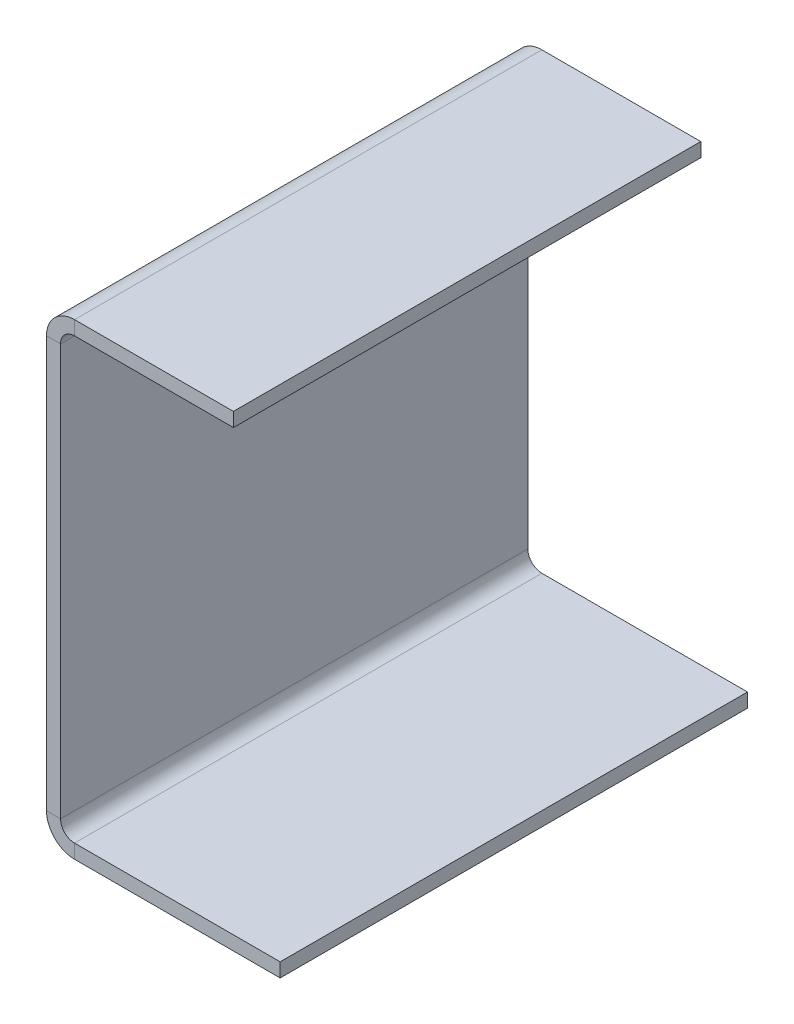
ISO-10303-21;
HEADER;
FILE_DESCRIPTION(('STEP AP214'),'2;1');
FILE_NAME('part.step','',(''),(''),'','','');
FILE_SCHEMA(('AUTOMOTIVE_DESIGN { 1 0 10303 214 1 1 1 1 }'));
ENDSEC;
DATA;
#1=APPLICATION_CONTEXT('core data for automotive mechanical design processes');
#2=APPLICATION_PROTOCOL_DEFINITION('international standard','automotive_design',2000,#1);
#3=PRODUCT_CONTEXT('',#1,'mechanical');
#4=PRODUCT('Part','Part','',(#3));
#5=PRODUCT_RELATED_PRODUCT_CATEGORY('part','',(#4));
#6=PRODUCT_DEFINITION_FORMATION('','',#4);
#7=PRODUCT_DEFINITION_CONTEXT('part definition',#1,'design');
#8=PRODUCT_DEFINITION('design','',#6,#7);
#9=PRODUCT_DEFINITION_SHAPE('','',#8);
#10=(LENGTH_UNIT() NAMED_UNIT(*) SI_UNIT(.MILLI.,.METRE.));
#11=(NAMED_UNIT(*) PLANE_ANGLE_UNIT() SI_UNIT($,.RADIAN.));
#12=(NAMED_UNIT(*) SI_UNIT($,.STERADIAN.) SOLID_ANGLE_UNIT());
#13=UNCERTAINTY_MEASURE_WITH_UNIT(LENGTH_MEASURE(1.E-05),#10,'distance_accuracy_value','');
#14=(GEOMETRIC_REPRESENTATION_CONTEXT(3) GLOBAL_UNCERTAINTY_ASSIGNED_CONTEXT((#13)) GLOBAL_UNIT_ASSIGNED_CONTEXT((#10,
#11,#12)) REPRESENTATION_CONTEXT('',''));
#15=CARTESIAN_POINT('',(0.,0.,0.));
#16=DIRECTION('',(0.,0.,1.));
#17=DIRECTION('',(1.,0.,0.));
#18=AXIS2_PLACEMENT_3D('',#15,#16,#17);
#19=CARTESIAN_POINT('',(0.,-44.,50.));
#20=DIRECTION('',(0.,0.,1.));
#21=DIRECTION('',(1.,0.,0.));
#22=AXIS2_PLACEMENT_3D('',#19,#20,#21);
#23=PLANE('',#22);
#24=DIRECTION('',(1.,0.,0.));
#25=VECTOR('',#24,1.);
#26=CARTESIAN_POINT('',(0.,-44.,50.));
#27=LINE('',#26,#25);
#28=CARTESIAN_POINT('',(0.,-44.,50.));
#29=VERTEX_POINT('',#28);
#30=CARTESIAN_POINT('',(3.,-44.,50.));
#31=VERTEX_POINT('',#30);
#32=EDGE_CURVE('E11',#29,#31,#27,.T.);
#33=ORIENTED_EDGE('',*,*,#32,.F.);
#34=CARTESIAN_POINT('',(6.,-44.,50.));
#35=DIRECTION('',(0.,0.,1.));
#36=DIRECTION('',(1.,0.,0.));
#37=AXIS2_PLACEMENT_3D('',#34,#35,#36);
#38=CIRCLE('',#37,6.);
#39=CARTESIAN_POINT('',(6.,-50.,50.));
#40=VERTEX_POINT('',#39);
#41=EDGE_CURVE('E244',#40,#29,#38,.F.);
#42=ORIENTED_EDGE('',*,*,#41,.F.);
#43=DIRECTION('',(0.,-1.,0.));
#44=VECTOR('',#43,1.);
#45=CARTESIAN_POINT('',(6.,-47.,50.));
#46=LINE('',#45,#44);
#47=CARTESIAN_POINT('',(6.,-47.,50.));
#48=VERTEX_POINT('',#47);
#49=EDGE_CURVE('E42',#48,#40,#46,.T.);
#50=ORIENTED_EDGE('',*,*,#49,.F.);
#51=CARTESIAN_POINT('',(6.,-44.,50.));
#52=DIRECTION('',(0.,0.,1.));
#53=DIRECTION('',(1.,0.,0.));
#54=AXIS2_PLACEMENT_3D('',#51,#52,#53);
#55=CIRCLE('',#54,3.);
#56=EDGE_CURVE('E143',#48,#31,#55,.F.);
#57=ORIENTED_EDGE('',*,*,#56,.T.);
#58=EDGE_LOOP('',(#33,#42,#50,#57));
#59=FACE_BOUND('',#58,.T.);
#60=ADVANCED_FACE('F34',(#59),#23,.T.);
#61=CARTESIAN_POINT('',(6.,-47.,50.));
#62=DIRECTION('',(0.,0.,1.));
#63=DIRECTION('',(1.,0.,0.));
#64=AXIS2_PLACEMENT_3D('',#61,#62,#63);
#65=PLANE('',#64);
#66=DIRECTION('',(0.,1.,0.));
#67=VECTOR('',#66,1.);
#68=CARTESIAN_POINT('',(0.,-50.,50.));
#69=LINE('',#68,#67);
#70=CARTESIAN_POINT('',(0.,44.,50.));
#71=VERTEX_POINT('',#70);
#72=EDGE_CURVE('E137',#29,#71,#69,.T.);
#73=ORIENTED_EDGE('',*,*,#72,.F.);
#74=ORIENTED_EDGE('',*,*,#32,.T.);
#75=DIRECTION('',(0.,1.,0.));
#76=VECTOR('',#75,1.);
#77=CARTESIAN_POINT('',(3.,-50.,50.));
#78=LINE('',#77,#76);
#79=CARTESIAN_POINT('',(2.99999999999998,44.,50.));
#80=VERTEX_POINT('',#79);
#81=EDGE_CURVE('E134',#31,#80,#78,.T.);
#82=ORIENTED_EDGE('',*,*,#81,.T.);
#83=DIRECTION('',(-1.,0.,0.));
#84=VECTOR('',#83,1.);
#85=CARTESIAN_POINT('',(2.99999999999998,44.,50.));
#86=LINE('',#85,#84);
#87=EDGE_CURVE('E225',#80,#71,#86,.T.);
#88=ORIENTED_EDGE('',*,*,#87,.T.);
#89=EDGE_LOOP('',(#73,#74,#82,#88));
#90=FACE_BOUND('',#89,.T.);
#91=ADVANCED_FACE('F132',(#90),#65,.T.);
#92=CARTESIAN_POINT('',(6.,-50.,-50.));
#93=DIRECTION('',(0.,0.,-1.));
#94=DIRECTION('',(-1.,0.,0.));
#95=AXIS2_PLACEMENT_3D('',#92,#93,#94);
#96=PLANE('',#95);
#97=DIRECTION('',(0.,1.,0.));
#98=VECTOR('',#97,1.);
#99=CARTESIAN_POINT('',(6.,-50.,-50.));
#100=LINE('',#99,#98);
#101=CARTESIAN_POINT('',(6.,-50.,-50.));
#102=VERTEX_POINT('',#101);
#103=CARTESIAN_POINT('',(6.,-47.,-50.));
#104=VERTEX_POINT('',#103);
#105=EDGE_CURVE('E230',#102,#104,#100,.T.);
#106=ORIENTED_EDGE('',*,*,#105,.F.);
#107=CARTESIAN_POINT('',(6.,-44.,-50.));
#108=DIRECTION('',(0.,0.,1.));
#109=DIRECTION('',(1.,0.,0.));
#110=AXIS2_PLACEMENT_3D('',#107,#108,#109);
#111=CIRCLE('',#110,6.);
#112=CARTESIAN_POINT('',(0.,-44.,-50.));
#113=VERTEX_POINT('',#112);
#114=EDGE_CURVE('E182',#102,#113,#111,.F.);
#115=ORIENTED_EDGE('',*,*,#114,.T.);
#116=DIRECTION('',(-1.,0.,0.));
#117=VECTOR('',#116,1.);
#118=CARTESIAN_POINT('',(3.,-44.,-50.));
#119=LINE('',#118,#117);
#120=CARTESIAN_POINT('',(3.,-44.,-50.));
#121=VERTEX_POINT('',#120);
#122=EDGE_CURVE('E228',#121,#113,#119,.T.);
#123=ORIENTED_EDGE('',*,*,#122,.F.);
#124=CARTESIAN_POINT('',(6.,-44.,-50.));
#125=DIRECTION('',(0.,0.,1.));
#126=DIRECTION('',(1.,0.,0.));
#127=AXIS2_PLACEMENT_3D('',#124,#125,#126);
#128=CIRCLE('',#127,3.);
#129=EDGE_CURVE('E155',#104,#121,#128,.F.);
#130=ORIENTED_EDGE('',*,*,#129,.F.);
#131=EDGE_LOOP('',(#106,#115,#123,#130));
#132=FACE_BOUND('',#131,.T.);
#133=ADVANCED_FACE('F282',(#132),#96,.T.);
#134=CARTESIAN_POINT('',(3.,-44.,-50.));
#135=DIRECTION('',(0.,0.,-1.));
#136=DIRECTION('',(-1.,0.,0.));
#137=AXIS2_PLACEMENT_3D('',#134,#135,#136);
#138=PLANE('',#137);
#139=DIRECTION('',(-1.,0.,0.));
#140=VECTOR('',#139,1.);
#141=CARTESIAN_POINT('',(50.,-50.,-50.));
#142=LINE('',#141,#140);
#143=CARTESIAN_POINT('',(50.,-50.,-50.));
#144=VERTEX_POINT('',#143);
#145=EDGE_CURVE('E185',#144,#102,#142,.T.);
#146=ORIENTED_EDGE('',*,*,#145,.T.);
#147=ORIENTED_EDGE('',*,*,#105,.T.);
#148=DIRECTION('',(-1.,0.,0.));
#149=VECTOR('',#148,1.);
#150=CARTESIAN_POINT('',(50.,-47.,-50.));
#151=LINE('',#150,#149);
#152=CARTESIAN_POINT('',(50.,-47.,-50.));
#153=VERTEX_POINT('',#152);
#154=EDGE_CURVE('E191',#153,#104,#151,.T.);
#155=ORIENTED_EDGE('',*,*,#154,.F.);
#156=DIRECTION('',(0.,-1.,0.));
#157=VECTOR('',#156,1.);
#158=CARTESIAN_POINT('',(50.,-47.,-50.));
#159=LINE('',#158,#157);
#160=EDGE_CURVE('E188',#153,#144,#159,.T.);
#161=ORIENTED_EDGE('',*,*,#160,.T.);
#162=EDGE_LOOP('',(#146,#147,#155,#161));
#163=FACE_BOUND('',#162,.T.);
#164=ADVANCED_FACE('F285',(#163),#138,.T.);
#165=CARTESIAN_POINT('',(5.99999999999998,50.,50.));
#166=DIRECTION('',(0.,0.,1.));
#167=DIRECTION('',(1.,0.,0.));
#168=AXIS2_PLACEMENT_3D('',#165,#166,#167);
#169=PLANE('',#168);
#170=DIRECTION('',(0.,-1.,0.));
#171=VECTOR('',#170,1.);
#172=CARTESIAN_POINT('',(5.99999999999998,50.,50.));
#173=LINE('',#172,#171);
#174=CARTESIAN_POINT('',(5.99999999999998,50.,50.));
#175=VERTEX_POINT('',#174);
#176=CARTESIAN_POINT('',(5.99999999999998,47.,50.));
#177=VERTEX_POINT('',#176);
#178=EDGE_CURVE('E50',#175,#177,#173,.T.);
#179=ORIENTED_EDGE('',*,*,#178,.F.);
#180=CARTESIAN_POINT('',(5.99999999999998,44.,50.));
#181=DIRECTION('',(0.,0.,1.));
#182=DIRECTION('',(1.,0.,0.));
#183=AXIS2_PLACEMENT_3D('',#180,#181,#182);
#184=CIRCLE('',#183,6.);
#185=EDGE_CURVE('E254',#71,#175,#184,.F.);
#186=ORIENTED_EDGE('',*,*,#185,.F.);
#187=ORIENTED_EDGE('',*,*,#87,.F.);
#188=CARTESIAN_POINT('',(5.99999999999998,44.,50.));
#189=DIRECTION('',(0.,0.,1.));
#190=DIRECTION('',(1.,0.,0.));
#191=AXIS2_PLACEMENT_3D('',#188,#189,#190);
#192=CIRCLE('',#191,3.);
#193=EDGE_CURVE('E163',#80,#177,#192,.F.);
#194=ORIENTED_EDGE('',*,*,#193,.T.);
#195=EDGE_LOOP('',(#179,#186,#187,#194));
#196=FACE_BOUND('',#195,.T.);
#197=ADVANCED_FACE('F277',(#196),#169,.T.);
#198=CARTESIAN_POINT('',(2.99999999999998,44.,50.));
#199=DIRECTION('',(0.,0.,1.));
#200=DIRECTION('',(1.,0.,0.));
#201=AXIS2_PLACEMENT_3D('',#198,#199,#200);
#202=PLANE('',#201);
#203=DIRECTION('',(1.,0.,0.));
#204=VECTOR('',#203,1.);
#205=CARTESIAN_POINT('',(0.,50.,50.));
#206=LINE('',#205,#204);
#207=CARTESIAN_POINT('',(40.,50.,50.));
#208=VERTEX_POINT('',#207);
#209=EDGE_CURVE('E257',#175,#208,#206,.T.);
#210=ORIENTED_EDGE('',*,*,#209,.F.);
#211=ORIENTED_EDGE('',*,*,#178,.T.);
#212=DIRECTION('',(1.,0.,0.));
#213=VECTOR('',#212,1.);
#214=CARTESIAN_POINT('',(0.,47.,50.));
#215=LINE('',#214,#213);
#216=CARTESIAN_POINT('',(40.,47.,50.));
#217=VERTEX_POINT('',#216);
#218=EDGE_CURVE('E104',#177,#217,#215,.T.);
#219=ORIENTED_EDGE('',*,*,#218,.T.);
#220=DIRECTION('',(0.,-1.,0.));
#221=VECTOR('',#220,1.);
#222=CARTESIAN_POINT('',(40.,50.,50.));
#223=LINE('',#222,#221);
#224=EDGE_CURVE('E260',#208,#217,#223,.T.);
#225=ORIENTED_EDGE('',*,*,#224,.F.);
#226=EDGE_LOOP('',(#210,#211,#219,#225));
#227=FACE_BOUND('',#226,.T.);
#228=ADVANCED_FACE('F266',(#227),#202,.T.);
#229=CARTESIAN_POINT('',(0.,44.,-50.));
#230=DIRECTION('',(0.,0.,-1.));
#231=DIRECTION('',(-1.,0.,0.));
#232=AXIS2_PLACEMENT_3D('',#229,#230,#231);
#233=PLANE('',#232);
#234=DIRECTION('',(1.,0.,0.));
#235=VECTOR('',#234,1.);
#236=CARTESIAN_POINT('',(0.,44.,-50.));
#237=LINE('',#236,#235);
#238=CARTESIAN_POINT('',(0.,44.,-50.));
#239=VERTEX_POINT('',#238);
#240=CARTESIAN_POINT('',(2.99999999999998,44.,-50.));
#241=VERTEX_POINT('',#240);
#242=EDGE_CURVE('E91',#239,#241,#237,.T.);
#243=ORIENTED_EDGE('',*,*,#242,.F.);
#244=CARTESIAN_POINT('',(5.99999999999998,44.,-50.));
#245=DIRECTION('',(0.,0.,1.));
#246=DIRECTION('',(1.,0.,0.));
#247=AXIS2_PLACEMENT_3D('',#244,#245,#246);
#248=CIRCLE('',#247,6.);
#249=CARTESIAN_POINT('',(5.99999999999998,50.,-50.));
#250=VERTEX_POINT('',#249);
#251=EDGE_CURVE('E178',#239,#250,#248,.F.);
#252=ORIENTED_EDGE('',*,*,#251,.T.);
#253=DIRECTION('',(0.,1.,0.));
#254=VECTOR('',#253,1.);
#255=CARTESIAN_POINT('',(5.99999999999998,47.,-50.));
#256=LINE('',#255,#254);
#257=CARTESIAN_POINT('',(5.99999999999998,47.,-50.));
#258=VERTEX_POINT('',#257);
#259=EDGE_CURVE('E98',#258,#250,#256,.T.);
#260=ORIENTED_EDGE('',*,*,#259,.F.);
#261=CARTESIAN_POINT('',(5.99999999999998,44.,-50.));
#262=DIRECTION('',(0.,0.,1.));
#263=DIRECTION('',(1.,0.,0.));
#264=AXIS2_PLACEMENT_3D('',#261,#262,#263);
#265=CIRCLE('',#264,3.);
#266=EDGE_CURVE('E197',#241,#258,#265,.F.);
#267=ORIENTED_EDGE('',*,*,#266,.F.);
#268=EDGE_LOOP('',(#243,#252,#260,#267));
#269=FACE_BOUND('',#268,.T.);
#270=ADVANCED_FACE('F314',(#269),#233,.T.);
#271=CARTESIAN_POINT('',(5.99999999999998,47.,-50.));
#272=DIRECTION('',(0.,0.,-1.));
#273=DIRECTION('',(-1.,0.,0.));
#274=AXIS2_PLACEMENT_3D('',#271,#272,#273);
#275=PLANE('',#274);
#276=DIRECTION('',(0.,1.,0.));
#277=VECTOR('',#276,1.);
#278=CARTESIAN_POINT('',(0.,-50.,-50.));
#279=LINE('',#278,#277);
#280=EDGE_CURVE('E180',#113,#239,#279,.T.);
#281=ORIENTED_EDGE('',*,*,#280,.T.);
#282=ORIENTED_EDGE('',*,*,#242,.T.);
#283=DIRECTION('',(0.,1.,0.));
#284=VECTOR('',#283,1.);
#285=CARTESIAN_POINT('',(3.,-50.,-50.));
#286=LINE('',#285,#284);
#287=EDGE_CURVE('E195',#121,#241,#286,.T.);
#288=ORIENTED_EDGE('',*,*,#287,.F.);
#289=ORIENTED_EDGE('',*,*,#122,.T.);
#290=EDGE_LOOP('',(#281,#282,#288,#289));
#291=FACE_BOUND('',#290,.T.);
#292=ADVANCED_FACE('F317',(#291),#275,.T.);
#293=CARTESIAN_POINT('',(0.,47.,50.));
#294=DIRECTION('',(0.,1.,0.));
#295=DIRECTION('',(0.,0.,1.));
#296=AXIS2_PLACEMENT_3D('',#293,#294,#295);
#297=PLANE('',#296);
#298=DIRECTION('',(1.,0.,0.));
#299=VECTOR('',#298,1.);
#300=CARTESIAN_POINT('',(0.,47.,-50.));
#301=LINE('',#300,#299);
#302=CARTESIAN_POINT('',(40.,47.,-50.));
#303=VERTEX_POINT('',#302);
#304=EDGE_CURVE('E169',#258,#303,#301,.T.);
#305=ORIENTED_EDGE('',*,*,#304,.T.);
#306=DIRECTION('',(0.,0.,-1.));
#307=VECTOR('',#306,1.);
#308=CARTESIAN_POINT('',(40.,47.,50.));
#309=LINE('',#308,#307);
#310=EDGE_CURVE('E221',#217,#303,#309,.T.);
#311=ORIENTED_EDGE('',*,*,#310,.F.);
#312=ORIENTED_EDGE('',*,*,#218,.F.);
#313=DIRECTION('',(0.,0.,-1.));
#314=VECTOR('',#313,1.);
#315=CARTESIAN_POINT('',(5.99999999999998,47.,50.));
#316=LINE('',#315,#314);
#317=EDGE_CURVE('E165',#177,#258,#316,.T.);
#318=ORIENTED_EDGE('',*,*,#317,.T.);
#319=EDGE_LOOP('',(#305,#311,#312,#318));
#320=FACE_BOUND('',#319,.T.);
#321=ADVANCED_FACE('F320',(#320),#297,.F.);
#322=CARTESIAN_POINT('',(40.,50.,50.));
#323=DIRECTION('',(1.,0.,0.));
#324=DIRECTION('',(0.,0.,-1.));
#325=AXIS2_PLACEMENT_3D('',#322,#323,#324);
#326=PLANE('',#325);
#327=DIRECTION('',(0.,-1.,0.));
#328=VECTOR('',#327,1.);
#329=CARTESIAN_POINT('',(40.,50.,-50.));
#330=LINE('',#329,#328);
#331=CARTESIAN_POINT('',(40.,50.,-50.));
#332=VERTEX_POINT('',#331);
#333=EDGE_CURVE('E172',#332,#303,#330,.T.);
#334=ORIENTED_EDGE('',*,*,#333,.F.);
#335=DIRECTION('',(0.,0.,-1.));
#336=VECTOR('',#335,1.);
#337=CARTESIAN_POINT('',(40.,50.,50.));
#338=LINE('',#337,#336);
#339=EDGE_CURVE('E219',#208,#332,#338,.T.);
#340=ORIENTED_EDGE('',*,*,#339,.F.);
#341=ORIENTED_EDGE('',*,*,#224,.T.);
#342=ORIENTED_EDGE('',*,*,#310,.T.);
#343=EDGE_LOOP('',(#334,#340,#341,#342));
#344=FACE_BOUND('',#343,.T.);
#345=ADVANCED_FACE('F265',(#344),#326,.T.);
#346=CARTESIAN_POINT('',(0.,50.,50.));
#347=DIRECTION('',(0.,1.,0.));
#348=DIRECTION('',(0.,0.,1.));
#349=AXIS2_PLACEMENT_3D('',#346,#347,#348);
#350=PLANE('',#349);
#351=DIRECTION('',(1.,0.,0.));
#352=VECTOR('',#351,1.);
#353=CARTESIAN_POINT('',(0.,50.,-50.));
#354=LINE('',#353,#352);
#355=EDGE_CURVE('E175',#250,#332,#354,.T.);
#356=ORIENTED_EDGE('',*,*,#355,.F.);
#357=DIRECTION('',(0.,0.,-1.));
#358=VECTOR('',#357,1.);
#359=CARTESIAN_POINT('',(5.99999999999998,50.,50.));
#360=LINE('',#359,#358);
#361=EDGE_CURVE('E216',#175,#250,#360,.T.);
#362=ORIENTED_EDGE('',*,*,#361,.F.);
#363=ORIENTED_EDGE('',*,*,#209,.T.);
#364=ORIENTED_EDGE('',*,*,#339,.T.);
#365=EDGE_LOOP('',(#356,#362,#363,#364));
#366=FACE_BOUND('',#365,.T.);
#367=ADVANCED_FACE('F270',(#366),#350,.T.);
#368=CARTESIAN_POINT('',(5.99999999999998,44.,50.));
#369=DIRECTION('',(0.,0.,-1.));
#370=DIRECTION('',(-1.,0.,0.));
#371=AXIS2_PLACEMENT_3D('',#368,#369,#370);
#372=CYLINDRICAL_SURFACE('',#371,6.);
#373=ORIENTED_EDGE('',*,*,#251,.F.);
#374=DIRECTION('',(0.,0.,-1.));
#375=VECTOR('',#374,1.);
#376=CARTESIAN_POINT('',(0.,44.,50.));
#377=LINE('',#376,#375);
#378=EDGE_CURVE('E213',#71,#239,#377,.T.);
#379=ORIENTED_EDGE('',*,*,#378,.F.);
#380=ORIENTED_EDGE('',*,*,#185,.T.);
#381=ORIENTED_EDGE('',*,*,#361,.T.);
#382=EDGE_LOOP('',(#373,#379,#380,#381));
#383=FACE_BOUND('',#382,.T.);
#384=ADVANCED_FACE('F273',(#383),#372,.T.);
#385=CARTESIAN_POINT('',(0.,-50.,50.));
#386=DIRECTION('',(-1.,0.,0.));
#387=DIRECTION('',(0.,-1.,0.));
#388=AXIS2_PLACEMENT_3D('',#385,#386,#387);
#389=PLANE('',#388);
#390=ORIENTED_EDGE('',*,*,#280,.F.);
#391=DIRECTION('',(0.,0.,-1.));
#392=VECTOR('',#391,1.);
#393=CARTESIAN_POINT('',(0.,-44.,50.));
#394=LINE('',#393,#392);
#395=EDGE_CURVE('E210',#29,#113,#394,.T.);
#396=ORIENTED_EDGE('',*,*,#395,.F.);
#397=ORIENTED_EDGE('',*,*,#72,.T.);
#398=ORIENTED_EDGE('',*,*,#378,.T.);
#399=EDGE_LOOP('',(#390,#396,#397,#398));
#400=FACE_BOUND('',#399,.T.);
#401=ADVANCED_FACE('F280',(#400),#389,.T.);
#402=CARTESIAN_POINT('',(6.,-44.,50.));
#403=DIRECTION('',(0.,0.,-1.));
#404=DIRECTION('',(-1.,0.,0.));
#405=AXIS2_PLACEMENT_3D('',#402,#403,#404);
#406=CYLINDRICAL_SURFACE('',#405,6.);
#407=ORIENTED_EDGE('',*,*,#114,.F.);
#408=DIRECTION('',(0.,0.,-1.));
#409=VECTOR('',#408,1.);
#410=CARTESIAN_POINT('',(6.,-50.,50.));
#411=LINE('',#410,#409);
#412=EDGE_CURVE('E207',#40,#102,#411,.T.);
#413=ORIENTED_EDGE('',*,*,#412,.F.);
#414=ORIENTED_EDGE('',*,*,#41,.T.);
#415=ORIENTED_EDGE('',*,*,#395,.T.);
#416=EDGE_LOOP('',(#407,#413,#414,#415));
#417=FACE_BOUND('',#416,.T.);
#418=ADVANCED_FACE('F243',(#417),#406,.T.);
#419=CARTESIAN_POINT('',(50.,-50.,50.));
#420=DIRECTION('',(0.,-1.,0.));
#421=DIRECTION('',(1.,0.,0.));
#422=AXIS2_PLACEMENT_3D('',#419,#420,#421);
#423=PLANE('',#422);
#424=ORIENTED_EDGE('',*,*,#145,.F.);
#425=DIRECTION('',(0.,0.,-1.));
#426=VECTOR('',#425,1.);
#427=CARTESIAN_POINT('',(50.,-50.,50.));
#428=LINE('',#427,#426);
#429=CARTESIAN_POINT('',(50.,-50.,50.));
#430=VERTEX_POINT('',#429);
#431=EDGE_CURVE('E205',#430,#144,#428,.T.);
#432=ORIENTED_EDGE('',*,*,#431,.F.);
#433=DIRECTION('',(-1.,0.,0.));
#434=VECTOR('',#433,1.);
#435=CARTESIAN_POINT('',(50.,-50.,50.));
#436=LINE('',#435,#434);
#437=EDGE_CURVE('E237',#430,#40,#436,.T.);
#438=ORIENTED_EDGE('',*,*,#437,.T.);
#439=ORIENTED_EDGE('',*,*,#412,.T.);
#440=EDGE_LOOP('',(#424,#432,#438,#439));
#441=FACE_BOUND('',#440,.T.);
#442=ADVANCED_FACE('F248',(#441),#423,.T.);
#443=CARTESIAN_POINT('',(50.,-47.,50.));
#444=DIRECTION('',(1.,0.,0.));
#445=DIRECTION('',(0.,0.,-1.));
#446=AXIS2_PLACEMENT_3D('',#443,#444,#445);
#447=PLANE('',#446);
#448=ORIENTED_EDGE('',*,*,#160,.F.);
#449=DIRECTION('',(0.,0.,-1.));
#450=VECTOR('',#449,1.);
#451=CARTESIAN_POINT('',(50.,-47.,50.));
#452=LINE('',#451,#450);
#453=CARTESIAN_POINT('',(50.,-47.,50.));
#454=VERTEX_POINT('',#453);
#455=EDGE_CURVE('E203',#454,#153,#452,.T.);
#456=ORIENTED_EDGE('',*,*,#455,.F.);
#457=DIRECTION('',(0.,-1.,0.));
#458=VECTOR('',#457,1.);
#459=CARTESIAN_POINT('',(50.,-47.,50.));
#460=LINE('',#459,#458);
#461=EDGE_CURVE('E249',#454,#430,#460,.T.);
#462=ORIENTED_EDGE('',*,*,#461,.T.);
#463=ORIENTED_EDGE('',*,*,#431,.T.);
#464=EDGE_LOOP('',(#448,#456,#462,#463));
#465=FACE_BOUND('',#464,.T.);
#466=ADVANCED_FACE('F290',(#465),#447,.T.);
#467=CARTESIAN_POINT('',(50.,-47.,50.));
#468=DIRECTION('',(0.,-1.,0.));
#469=DIRECTION('',(1.,0.,0.));
#470=AXIS2_PLACEMENT_3D('',#467,#468,#469);
#471=PLANE('',#470);
#472=ORIENTED_EDGE('',*,*,#154,.T.);
#473=DIRECTION('',(0.,0.,-1.));
#474=VECTOR('',#473,1.);
#475=CARTESIAN_POINT('',(6.,-47.,50.));
#476=LINE('',#475,#474);
#477=EDGE_CURVE('E157',#48,#104,#476,.T.);
#478=ORIENTED_EDGE('',*,*,#477,.F.);
#479=DIRECTION('',(-1.,0.,0.));
#480=VECTOR('',#479,1.);
#481=CARTESIAN_POINT('',(50.,-47.,50.));
#482=LINE('',#481,#480);
#483=EDGE_CURVE('E148',#454,#48,#482,.T.);
#484=ORIENTED_EDGE('',*,*,#483,.F.);
#485=ORIENTED_EDGE('',*,*,#455,.T.);
#486=EDGE_LOOP('',(#472,#478,#484,#485));
#487=FACE_BOUND('',#486,.T.);
#488=ADVANCED_FACE('F288',(#487),#471,.F.);
#489=CARTESIAN_POINT('',(6.,-44.,50.));
#490=DIRECTION('',(0.,0.,-1.));
#491=DIRECTION('',(-1.,0.,0.));
#492=AXIS2_PLACEMENT_3D('',#489,#490,#491);
#493=CYLINDRICAL_SURFACE('',#492,3.);
#494=ORIENTED_EDGE('',*,*,#129,.T.);
#495=DIRECTION('',(0.,0.,-1.));
#496=VECTOR('',#495,1.);
#497=CARTESIAN_POINT('',(3.,-44.,50.));
#498=LINE('',#497,#496);
#499=EDGE_CURVE('E152',#31,#121,#498,.T.);
#500=ORIENTED_EDGE('',*,*,#499,.F.);
#501=ORIENTED_EDGE('',*,*,#56,.F.);
#502=ORIENTED_EDGE('',*,*,#477,.T.);
#503=EDGE_LOOP('',(#494,#500,#501,#502));
#504=FACE_BOUND('',#503,.T.);
#505=ADVANCED_FACE('F153',(#504),#493,.F.);
#506=CARTESIAN_POINT('',(3.,-50.,50.));
#507=DIRECTION('',(-1.,0.,0.));
#508=DIRECTION('',(0.,-1.,0.));
#509=AXIS2_PLACEMENT_3D('',#506,#507,#508);
#510=PLANE('',#509);
#511=ORIENTED_EDGE('',*,*,#287,.T.);
#512=DIRECTION('',(0.,0.,-1.));
#513=VECTOR('',#512,1.);
#514=CARTESIAN_POINT('',(2.99999999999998,44.,50.));
#515=LINE('',#514,#513);
#516=EDGE_CURVE('E158',#80,#241,#515,.T.);
#517=ORIENTED_EDGE('',*,*,#516,.F.);
#518=ORIENTED_EDGE('',*,*,#81,.F.);
#519=ORIENTED_EDGE('',*,*,#499,.T.);
#520=EDGE_LOOP('',(#511,#517,#518,#519));
#521=FACE_BOUND('',#520,.T.);
#522=ADVANCED_FACE('F160',(#521),#510,.F.);
#523=CARTESIAN_POINT('',(5.99999999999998,44.,50.));
#524=DIRECTION('',(0.,0.,-1.));
#525=DIRECTION('',(-1.,0.,0.));
#526=AXIS2_PLACEMENT_3D('',#523,#524,#525);
#527=CYLINDRICAL_SURFACE('',#526,3.);
#528=ORIENTED_EDGE('',*,*,#266,.T.);
#529=ORIENTED_EDGE('',*,*,#317,.F.);
#530=ORIENTED_EDGE('',*,*,#193,.F.);
#531=ORIENTED_EDGE('',*,*,#516,.T.);
#532=EDGE_LOOP('',(#528,#529,#530,#531));
#533=FACE_BOUND('',#532,.T.);
#534=ADVANCED_FACE('F372',(#533),#527,.F.);
#535=CARTESIAN_POINT('',(5.99999999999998,44.,50.));
#536=DIRECTION('',(0.,0.,1.));
#537=DIRECTION('',(1.,0.,0.));
#538=AXIS2_PLACEMENT_3D('',#535,#536,#537);
#539=PLANE('',#538);
#540=ORIENTED_EDGE('',*,*,#483,.T.);
#541=ORIENTED_EDGE('',*,*,#49,.T.);
#542=ORIENTED_EDGE('',*,*,#437,.F.);
#543=ORIENTED_EDGE('',*,*,#461,.F.);
#544=EDGE_LOOP('',(#540,#541,#542,#543));
#545=FACE_BOUND('',#544,.T.);
#546=ADVANCED_FACE('F234',(#545),#539,.T.);
#547=CARTESIAN_POINT('',(5.99999999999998,44.,-50.));
#548=DIRECTION('',(0.,0.,1.));
#549=DIRECTION('',(1.,0.,0.));
#550=AXIS2_PLACEMENT_3D('',#547,#548,#549);
#551=PLANE('',#550);
#552=ORIENTED_EDGE('',*,*,#304,.F.);
#553=ORIENTED_EDGE('',*,*,#259,.T.);
#554=ORIENTED_EDGE('',*,*,#355,.T.);
#555=ORIENTED_EDGE('',*,*,#333,.T.);
#556=EDGE_LOOP('',(#552,#553,#554,#555));
#557=FACE_BOUND('',#556,.T.);
#558=ADVANCED_FACE('F392',(#557),#551,.F.);
#559=CLOSED_SHELL('',(#60,#91,#133,#164,#197,#228,#270,#292,#321,#345,#367,#384,#401,#418,#442,
#466,#488,#505,#522,#534,#546,#558));
#560=MANIFOLD_SOLID_BREP('B2',#559);
#561=ADVANCED_BREP_SHAPE_REPRESENTATION('',(#18,#560),#14);
#562=SHAPE_DEFINITION_REPRESENTATION(#9,#561);
ENDSEC;
END-ISO-10303-21;
